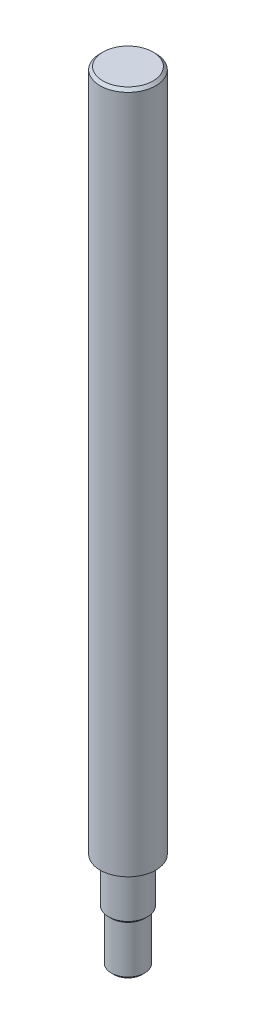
ISO-10303-21;
HEADER;
FILE_DESCRIPTION(('STEP AP214'),'2;1');
FILE_NAME('part.step','',(''),(''),'','','');
FILE_SCHEMA(('AUTOMOTIVE_DESIGN { 1 0 10303 214 1 1 1 1 }'));
ENDSEC;
DATA;
#1=APPLICATION_CONTEXT('core data for automotive mechanical design processes');
#2=APPLICATION_PROTOCOL_DEFINITION('international standard','automotive_design',2000,#1);
#3=PRODUCT_CONTEXT('',#1,'mechanical');
#4=PRODUCT('Part','Part','',(#3));
#5=PRODUCT_RELATED_PRODUCT_CATEGORY('part','',(#4));
#6=PRODUCT_DEFINITION_FORMATION('','',#4);
#7=PRODUCT_DEFINITION_CONTEXT('part definition',#1,'design');
#8=PRODUCT_DEFINITION('design','',#6,#7);
#9=PRODUCT_DEFINITION_SHAPE('','',#8);
#10=(LENGTH_UNIT() NAMED_UNIT(*) SI_UNIT(.MILLI.,.METRE.));
#11=(NAMED_UNIT(*) PLANE_ANGLE_UNIT() SI_UNIT($,.RADIAN.));
#12=(NAMED_UNIT(*) SI_UNIT($,.STERADIAN.) SOLID_ANGLE_UNIT());
#13=UNCERTAINTY_MEASURE_WITH_UNIT(LENGTH_MEASURE(1.E-05),#10,'distance_accuracy_value','');
#14=(GEOMETRIC_REPRESENTATION_CONTEXT(3) GLOBAL_UNCERTAINTY_ASSIGNED_CONTEXT((#13)) GLOBAL_UNIT_ASSIGNED_CONTEXT((#10,
#11,#12)) REPRESENTATION_CONTEXT('',''));
#15=CARTESIAN_POINT('',(0.,0.,0.));
#16=DIRECTION('',(0.,0.,1.));
#17=DIRECTION('',(1.,0.,0.));
#18=AXIS2_PLACEMENT_3D('',#15,#16,#17);
#19=CARTESIAN_POINT('',(0.,-35.,0.));
#20=DIRECTION('',(0.,1.,0.));
#21=DIRECTION('',(0.,0.,1.));
#22=AXIS2_PLACEMENT_3D('',#19,#20,#21);
#23=CYLINDRICAL_SURFACE('',#22,6.);
#24=CARTESIAN_POINT('',(0.,-34.,0.));
#25=DIRECTION('',(0.,-1.,0.));
#26=DIRECTION('',(0.,0.,-1.));
#27=AXIS2_PLACEMENT_3D('',#24,#25,#26);
#28=CIRCLE('',#27,6.);
#29=CARTESIAN_POINT('',(0.,-34.,-6.));
#30=VERTEX_POINT('',#29);
#31=EDGE_CURVE('E11',#30,#30,#28,.F.);
#32=ORIENTED_EDGE('',*,*,#31,.T.);
#33=EDGE_LOOP('',(#32));
#34=FACE_BOUND('',#33,.T.);
#35=CARTESIAN_POINT('',(0.,-17.,0.));
#36=DIRECTION('',(0.,-1.,0.));
#37=DIRECTION('',(0.,0.,-1.));
#38=AXIS2_PLACEMENT_3D('',#35,#36,#37);
#39=CIRCLE('',#38,6.);
#40=CARTESIAN_POINT('',(0.,-17.,-6.));
#41=VERTEX_POINT('',#40);
#42=EDGE_CURVE('E53',#41,#41,#39,.T.);
#43=ORIENTED_EDGE('',*,*,#42,.T.);
#44=EDGE_LOOP('',(#43));
#45=FACE_BOUND('',#44,.T.);
#46=ADVANCED_FACE('F42',(#34,#45),#23,.T.);
#47=CARTESIAN_POINT('',(0.,-35.,0.));
#48=DIRECTION('',(0.,-1.,0.));
#49=DIRECTION('',(0.,0.,-1.));
#50=AXIS2_PLACEMENT_3D('',#47,#48,#49);
#51=PLANE('',#50);
#52=CARTESIAN_POINT('',(0.,-35.,0.));
#53=DIRECTION('',(0.,-1.,0.));
#54=DIRECTION('',(0.,0.,-1.));
#55=AXIS2_PLACEMENT_3D('',#52,#53,#54);
#56=CIRCLE('',#55,5.);
#57=CARTESIAN_POINT('',(0.,-35.,-5.));
#58=VERTEX_POINT('',#57);
#59=EDGE_CURVE('E49',#58,#58,#56,.T.);
#60=ORIENTED_EDGE('',*,*,#59,.T.);
#61=EDGE_LOOP('',(#60));
#62=FACE_BOUND('',#61,.T.);
#63=ADVANCED_FACE('F63',(#62),#51,.T.);
#64=CARTESIAN_POINT('',(0.,-17.,0.));
#65=DIRECTION('',(0.,-1.,0.));
#66=DIRECTION('',(0.,0.,-1.));
#67=AXIS2_PLACEMENT_3D('',#64,#65,#66);
#68=PLANE('',#67);
#69=ORIENTED_EDGE('',*,*,#42,.F.);
#70=EDGE_LOOP('',(#69));
#71=FACE_BOUND('',#70,.T.);
#72=ADVANCED_FACE('F61',(#71),#68,.F.);
#73=CARTESIAN_POINT('',(0.,-35.,0.));
#74=DIRECTION('',(0.,1.,0.));
#75=DIRECTION('',(0.,0.,1.));
#76=AXIS2_PLACEMENT_3D('',#73,#74,#75);
#77=CONICAL_SURFACE('',#76,5.,0.785398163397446);
#78=ORIENTED_EDGE('',*,*,#31,.F.);
#79=EDGE_LOOP('',(#78));
#80=FACE_BOUND('',#79,.T.);
#81=ORIENTED_EDGE('',*,*,#59,.F.);
#82=EDGE_LOOP('',(#81));
#83=FACE_BOUND('',#82,.T.);
#84=ADVANCED_FACE('F44',(#80,#83),#77,.T.);
#85=CLOSED_SHELL('',(#46,#63,#72,#84));
#86=MANIFOLD_SOLID_BREP('B2',#85);
#87=CARTESIAN_POINT('',(0.,245.,0.));
#88=DIRECTION('',(0.,-1.,0.));
#89=DIRECTION('',(0.,0.,-1.));
#90=AXIS2_PLACEMENT_3D('',#87,#88,#89);
#91=CYLINDRICAL_SURFACE('',#90,10.);
#92=CARTESIAN_POINT('',(0.,244.,0.));
#93=DIRECTION('',(0.,1.,0.));
#94=DIRECTION('',(0.,0.,1.));
#95=AXIS2_PLACEMENT_3D('',#92,#93,#94);
#96=CIRCLE('',#95,10.);
#97=CARTESIAN_POINT('',(0.,244.,10.));
#98=VERTEX_POINT('',#97);
#99=EDGE_CURVE('E41',#98,#98,#96,.F.);
#100=ORIENTED_EDGE('',*,*,#99,.T.);
#101=EDGE_LOOP('',(#100));
#102=FACE_BOUND('',#101,.T.);
#103=CARTESIAN_POINT('',(0.,0.,0.));
#104=DIRECTION('',(0.,1.,0.));
#105=DIRECTION('',(0.,0.,1.));
#106=AXIS2_PLACEMENT_3D('',#103,#104,#105);
#107=CIRCLE('',#106,10.);
#108=CARTESIAN_POINT('',(0.,0.,10.));
#109=VERTEX_POINT('',#108);
#110=EDGE_CURVE('E120',#109,#109,#107,.T.);
#111=ORIENTED_EDGE('',*,*,#110,.T.);
#112=EDGE_LOOP('',(#111));
#113=FACE_BOUND('',#112,.T.);
#114=ADVANCED_FACE('F97',(#102,#113),#91,.T.);
#115=CARTESIAN_POINT('',(0.,245.,0.));
#116=DIRECTION('',(0.,1.,0.));
#117=DIRECTION('',(0.,0.,1.));
#118=AXIS2_PLACEMENT_3D('',#115,#116,#117);
#119=PLANE('',#118);
#120=CARTESIAN_POINT('',(0.,245.,0.));
#121=DIRECTION('',(0.,1.,0.));
#122=DIRECTION('',(0.,0.,1.));
#123=AXIS2_PLACEMENT_3D('',#120,#121,#122);
#124=CIRCLE('',#123,9.00000000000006);
#125=CARTESIAN_POINT('',(0.,245.,9.00000000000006));
#126=VERTEX_POINT('',#125);
#127=EDGE_CURVE('E104',#126,#126,#124,.T.);
#128=ORIENTED_EDGE('',*,*,#127,.T.);
#129=EDGE_LOOP('',(#128));
#130=FACE_BOUND('',#129,.T.);
#131=ADVANCED_FACE('F128',(#130),#119,.T.);
#132=CARTESIAN_POINT('',(0.,0.,0.));
#133=DIRECTION('',(0.,1.,0.));
#134=DIRECTION('',(0.,0.,1.));
#135=AXIS2_PLACEMENT_3D('',#132,#133,#134);
#136=PLANE('',#135);
#137=CARTESIAN_POINT('',(0.,0.,0.));
#138=DIRECTION('',(0.,1.,0.));
#139=DIRECTION('',(0.,0.,1.));
#140=AXIS2_PLACEMENT_3D('',#137,#138,#139);
#141=CIRCLE('',#140,7.);
#142=CARTESIAN_POINT('',(0.,0.,7.));
#143=VERTEX_POINT('',#142);
#144=EDGE_CURVE('E117',#143,#143,#141,.F.);
#145=ORIENTED_EDGE('',*,*,#144,.F.);
#146=EDGE_LOOP('',(#145));
#147=FACE_BOUND('',#146,.T.);
#148=ORIENTED_EDGE('',*,*,#110,.F.);
#149=EDGE_LOOP('',(#148));
#150=FACE_BOUND('',#149,.T.);
#151=ADVANCED_FACE('F125',(#147,#150),#136,.F.);
#152=CARTESIAN_POINT('',(0.,-17.,0.));
#153=DIRECTION('',(0.,1.,0.));
#154=DIRECTION('',(0.,0.,1.));
#155=AXIS2_PLACEMENT_3D('',#152,#153,#154);
#156=CYLINDRICAL_SURFACE('',#155,7.);
#157=CARTESIAN_POINT('',(0.,-16.,0.));
#158=DIRECTION('',(0.,-1.,0.));
#159=DIRECTION('',(0.,0.,-1.));
#160=AXIS2_PLACEMENT_3D('',#157,#158,#159);
#161=CIRCLE('',#160,7.);
#162=CARTESIAN_POINT('',(0.,-16.,-7.));
#163=VERTEX_POINT('',#162);
#164=EDGE_CURVE('E108',#163,#163,#161,.F.);
#165=ORIENTED_EDGE('',*,*,#164,.T.);
#166=EDGE_LOOP('',(#165));
#167=FACE_BOUND('',#166,.T.);
#168=ORIENTED_EDGE('',*,*,#144,.T.);
#169=EDGE_LOOP('',(#168));
#170=FACE_BOUND('',#169,.T.);
#171=ADVANCED_FACE('F127',(#167,#170),#156,.T.);
#172=CARTESIAN_POINT('',(0.,-17.,0.));
#173=DIRECTION('',(0.,-1.,0.));
#174=DIRECTION('',(0.,0.,-1.));
#175=AXIS2_PLACEMENT_3D('',#172,#173,#174);
#176=PLANE('',#175);
#177=CARTESIAN_POINT('',(0.,-17.,0.));
#178=DIRECTION('',(0.,-1.,0.));
#179=DIRECTION('',(0.,0.,-1.));
#180=AXIS2_PLACEMENT_3D('',#177,#178,#179);
#181=CIRCLE('',#180,6.00000000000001);
#182=CARTESIAN_POINT('',(0.,-17.,-6.00000000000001));
#183=VERTEX_POINT('',#182);
#184=EDGE_CURVE('E112',#183,#183,#181,.T.);
#185=ORIENTED_EDGE('',*,*,#184,.T.);
#186=EDGE_LOOP('',(#185));
#187=FACE_BOUND('',#186,.T.);
#188=ADVANCED_FACE('F135',(#187),#176,.T.);
#189=CARTESIAN_POINT('',(0.,-17.,0.));
#190=DIRECTION('',(0.,1.,0.));
#191=DIRECTION('',(0.,0.,1.));
#192=AXIS2_PLACEMENT_3D('',#189,#190,#191);
#193=CONICAL_SURFACE('',#192,6.00000000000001,0.785398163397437);
#194=ORIENTED_EDGE('',*,*,#164,.F.);
#195=EDGE_LOOP('',(#194));
#196=FACE_BOUND('',#195,.T.);
#197=ORIENTED_EDGE('',*,*,#184,.F.);
#198=EDGE_LOOP('',(#197));
#199=FACE_BOUND('',#198,.T.);
#200=ADVANCED_FACE('F144',(#196,#199),#193,.T.);
#201=CARTESIAN_POINT('',(0.,245.,0.));
#202=DIRECTION('',(0.,-1.,0.));
#203=DIRECTION('',(0.,0.,-1.));
#204=AXIS2_PLACEMENT_3D('',#201,#202,#203);
#205=CONICAL_SURFACE('',#204,9.00000000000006,0.785398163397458);
#206=ORIENTED_EDGE('',*,*,#99,.F.);
#207=EDGE_LOOP('',(#206));
#208=FACE_BOUND('',#207,.T.);
#209=ORIENTED_EDGE('',*,*,#127,.F.);
#210=EDGE_LOOP('',(#209));
#211=FACE_BOUND('',#210,.T.);
#212=ADVANCED_FACE('F99',(#208,#211),#205,.T.);
#213=CLOSED_SHELL('',(#114,#131,#151,#171,#188,#200,#212));
#214=MANIFOLD_SOLID_BREP('B6',#213);
#215=ADVANCED_BREP_SHAPE_REPRESENTATION('',(#18,#86,#214),#14);
#216=SHAPE_DEFINITION_REPRESENTATION(#9,#215);
ENDSEC;
END-ISO-10303-21;
